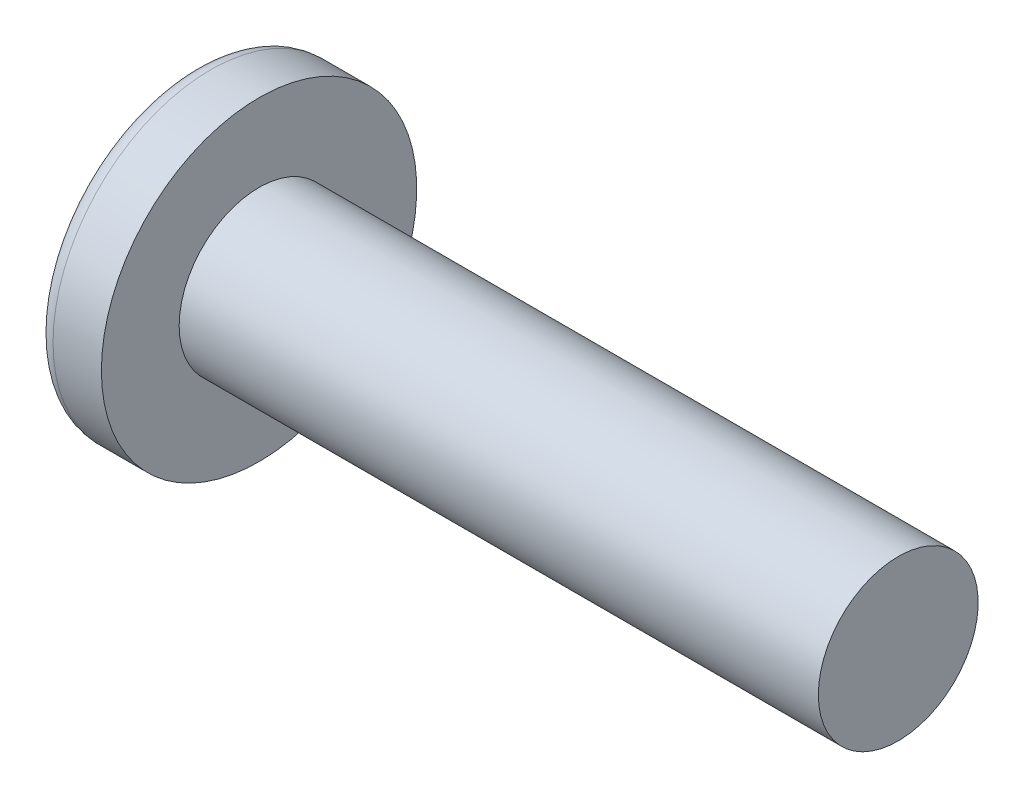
from build123d import *

# Parameters (mm, degrees)
CIRPATTERN1_COUNT = 2
CIRPATTERN1_ANGLE = 90


with BuildPart() as part:
    # BodySke → Base-Revolve (revolve)
    with BuildSketch(Plane.XY, mode=Mode.PRIVATE) as base_revolve_sk:
        with BuildLine():
            Line((6.6294, 4.7625), (6.6294, 9.398))
            Line((6.6294, 9.398), (3.748078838, 9.398))
            ThreePointArc((3.748078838, 9.398), (3.287664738, 9.287690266), (2.927227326, 8.980714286))
            ThreePointArc((2.927227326, 8.980714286), (0.750275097, 4.72286695), (0, 0))
            Line((0, 0), (44.7294, 0))
            Line((44.7294, 0), (44.7294, 4.7625))
            Line((44.7294, 4.7625), (6.6294, 4.7625))
        make_face()
    revolve(base_revolve_sk.sketch.rotate(Axis((-25.4, 0, 0), (1, 0, 0)), 90), axis=Axis((-25.4, 0, 0), (1, 0, 0)))

    # Sketch3 → Cut-Loft1 section 0
    with BuildSketch(Plane(origin=(0, 0, 0), x_dir=(0, 0, -1), z_dir=(1, 0, 0))):
        with BuildLine():
            Line((1.0287, -6.096), (-1.0287, -6.096))
            Line((-1.0287, -6.096), (-1.0287, 6.096))
            Line((-1.0287, 6.096), (1.0287, 6.096))
            Line((1.0287, 6.096), (1.0287, -6.096))
        make_face()
    # Sketch4 → Cut-Loft1 section 1
    with BuildSketch(Plane(origin=(7.2644, 0, 0), x_dir=(0, 0, -1), z_dir=(1, 0, 0))):
        with BuildLine():
            Line((0.51435, -0.51435), (-0.51435, -0.51435))
            Line((-0.51435, -0.51435), (-0.51435, 0.51435))
            Line((-0.51435, 0.51435), (0.51435, 0.51435))
            Line((0.51435, 0.51435), (0.51435, -0.51435))
        make_face()
    cut_loft1 = loft(mode=Mode.SUBTRACT)

    # CirPattern1: Cut-Loft1 ×2 about axis
    cirpattern1_axis = Axis((0, 0, 0), (-1, 0, 0))
    for i in range(1, CIRPATTERN1_COUNT):
        add(cut_loft1.rotate(cirpattern1_axis, i * CIRPATTERN1_ANGLE / (CIRPATTERN1_COUNT - 1)), mode=Mode.SUBTRACT)


solid = part.part
